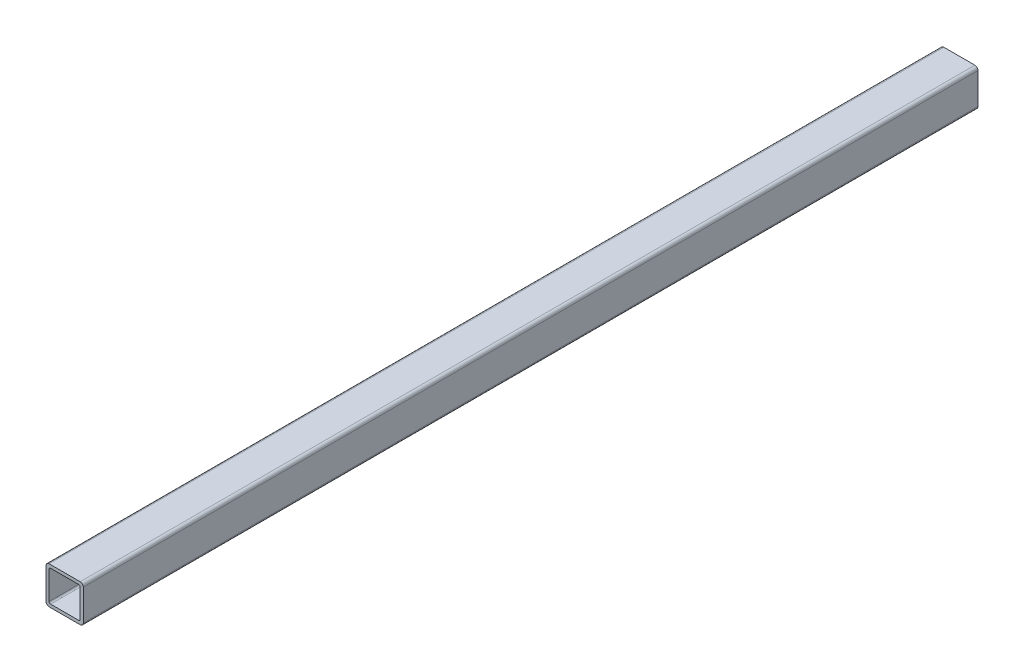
ISO-10303-21;
HEADER;
FILE_DESCRIPTION(('STEP AP214'),'2;1');
FILE_NAME('part.step','',(''),(''),'','','');
FILE_SCHEMA(('AUTOMOTIVE_DESIGN { 1 0 10303 214 1 1 1 1 }'));
ENDSEC;
DATA;
#1=APPLICATION_CONTEXT('core data for automotive mechanical design processes');
#2=APPLICATION_PROTOCOL_DEFINITION('international standard','automotive_design',2000,#1);
#3=PRODUCT_CONTEXT('',#1,'mechanical');
#4=PRODUCT('Part','Part','',(#3));
#5=PRODUCT_RELATED_PRODUCT_CATEGORY('part','',(#4));
#6=PRODUCT_DEFINITION_FORMATION('','',#4);
#7=PRODUCT_DEFINITION_CONTEXT('part definition',#1,'design');
#8=PRODUCT_DEFINITION('design','',#6,#7);
#9=PRODUCT_DEFINITION_SHAPE('','',#8);
#10=(LENGTH_UNIT() NAMED_UNIT(*) SI_UNIT(.MILLI.,.METRE.));
#11=(NAMED_UNIT(*) PLANE_ANGLE_UNIT() SI_UNIT($,.RADIAN.));
#12=(NAMED_UNIT(*) SI_UNIT($,.STERADIAN.) SOLID_ANGLE_UNIT());
#13=UNCERTAINTY_MEASURE_WITH_UNIT(LENGTH_MEASURE(1.E-05),#10,'distance_accuracy_value','');
#14=(GEOMETRIC_REPRESENTATION_CONTEXT(3) GLOBAL_UNCERTAINTY_ASSIGNED_CONTEXT((#13)) GLOBAL_UNIT_ASSIGNED_CONTEXT((#10,
#11,#12)) REPRESENTATION_CONTEXT('',''));
#15=CARTESIAN_POINT('',(0.,0.,0.));
#16=DIRECTION('',(0.,0.,1.));
#17=DIRECTION('',(1.,0.,0.));
#18=AXIS2_PLACEMENT_3D('',#15,#16,#17);
#19=CARTESIAN_POINT('',(-15.875,-15.875,457.2));
#20=DIRECTION('',(0.,0.,1.));
#21=DIRECTION('',(1.,0.,0.));
#22=AXIS2_PLACEMENT_3D('',#19,#20,#21);
#23=PLANE('',#22);
#24=CARTESIAN_POINT('',(-15.875,-15.875,457.2));
#25=DIRECTION('',(0.,0.,1.));
#26=DIRECTION('',(1.,0.,0.));
#27=AXIS2_PLACEMENT_3D('',#24,#25,#26);
#28=CIRCLE('',#27,3.175);
#29=CARTESIAN_POINT('',(-19.05,-15.875,457.2));
#30=VERTEX_POINT('',#29);
#31=CARTESIAN_POINT('',(-15.875,-19.05,457.2));
#32=VERTEX_POINT('',#31);
#33=EDGE_CURVE('E211',#30,#32,#28,.T.);
#34=ORIENTED_EDGE('',*,*,#33,.T.);
#35=DIRECTION('',(1.,0.,0.));
#36=VECTOR('',#35,1.);
#37=CARTESIAN_POINT('',(-15.875,-19.05,457.2));
#38=LINE('',#37,#36);
#39=CARTESIAN_POINT('',(15.875,-19.05,457.2));
#40=VERTEX_POINT('',#39);
#41=EDGE_CURVE('E214',#32,#40,#38,.T.);
#42=ORIENTED_EDGE('',*,*,#41,.T.);
#43=CARTESIAN_POINT('',(15.875,-15.875,457.2));
#44=DIRECTION('',(0.,0.,1.));
#45=DIRECTION('',(1.,0.,0.));
#46=AXIS2_PLACEMENT_3D('',#43,#44,#45);
#47=CIRCLE('',#46,3.175);
#48=CARTESIAN_POINT('',(19.05,-15.875,457.2));
#49=VERTEX_POINT('',#48);
#50=EDGE_CURVE('E217',#40,#49,#47,.T.);
#51=ORIENTED_EDGE('',*,*,#50,.T.);
#52=DIRECTION('',(0.,1.,0.));
#53=VECTOR('',#52,1.);
#54=CARTESIAN_POINT('',(19.05,15.875,457.2));
#55=LINE('',#54,#53);
#56=CARTESIAN_POINT('',(19.05,15.875,457.2));
#57=VERTEX_POINT('',#56);
#58=EDGE_CURVE('E219',#49,#57,#55,.T.);
#59=ORIENTED_EDGE('',*,*,#58,.T.);
#60=CARTESIAN_POINT('',(15.875,15.875,457.2));
#61=DIRECTION('',(0.,0.,1.));
#62=DIRECTION('',(-1.,0.,0.));
#63=AXIS2_PLACEMENT_3D('',#60,#61,#62);
#64=CIRCLE('',#63,3.175);
#65=CARTESIAN_POINT('',(15.875,19.05,457.2));
#66=VERTEX_POINT('',#65);
#67=EDGE_CURVE('E221',#57,#66,#64,.T.);
#68=ORIENTED_EDGE('',*,*,#67,.T.);
#69=DIRECTION('',(-1.,0.,0.));
#70=VECTOR('',#69,1.);
#71=CARTESIAN_POINT('',(-15.875,19.05,457.2));
#72=LINE('',#71,#70);
#73=CARTESIAN_POINT('',(-15.875,19.05,457.2));
#74=VERTEX_POINT('',#73);
#75=EDGE_CURVE('E223',#66,#74,#72,.T.);
#76=ORIENTED_EDGE('',*,*,#75,.T.);
#77=CARTESIAN_POINT('',(-15.875,15.875,457.2));
#78=DIRECTION('',(0.,0.,1.));
#79=DIRECTION('',(1.,0.,0.));
#80=AXIS2_PLACEMENT_3D('',#77,#78,#79);
#81=CIRCLE('',#80,3.175);
#82=CARTESIAN_POINT('',(-19.05,15.875,457.2));
#83=VERTEX_POINT('',#82);
#84=EDGE_CURVE('E225',#74,#83,#81,.T.);
#85=ORIENTED_EDGE('',*,*,#84,.T.);
#86=DIRECTION('',(0.,-1.,0.));
#87=VECTOR('',#86,1.);
#88=CARTESIAN_POINT('',(-19.05,15.875,457.2));
#89=LINE('',#88,#87);
#90=EDGE_CURVE('E227',#83,#30,#89,.T.);
#91=ORIENTED_EDGE('',*,*,#90,.T.);
#92=EDGE_LOOP('',(#34,#42,#51,#59,#68,#76,#85,#91));
#93=FACE_BOUND('',#92,.T.);
#94=DIRECTION('',(0.,-1.,0.));
#95=VECTOR('',#94,1.);
#96=CARTESIAN_POINT('',(-15.875,14.2875,457.2));
#97=LINE('',#96,#95);
#98=CARTESIAN_POINT('',(-15.875,14.2875,457.2));
#99=VERTEX_POINT('',#98);
#100=CARTESIAN_POINT('',(-15.875,-14.2875,457.2));
#101=VERTEX_POINT('',#100);
#102=EDGE_CURVE('E154',#99,#101,#97,.T.);
#103=ORIENTED_EDGE('',*,*,#102,.F.);
#104=CARTESIAN_POINT('',(-14.2875,14.2875,457.2));
#105=DIRECTION('',(0.,0.,1.));
#106=DIRECTION('',(1.,0.,0.));
#107=AXIS2_PLACEMENT_3D('',#104,#105,#106);
#108=CIRCLE('',#107,1.5875);
#109=CARTESIAN_POINT('',(-14.2875,15.875,457.2));
#110=VERTEX_POINT('',#109);
#111=EDGE_CURVE('E146',#110,#99,#108,.T.);
#112=ORIENTED_EDGE('',*,*,#111,.F.);
#113=DIRECTION('',(-1.,0.,0.));
#114=VECTOR('',#113,1.);
#115=CARTESIAN_POINT('',(-14.2875,15.875,457.2));
#116=LINE('',#115,#114);
#117=CARTESIAN_POINT('',(14.2875,15.875,457.2));
#118=VERTEX_POINT('',#117);
#119=EDGE_CURVE('E179',#118,#110,#116,.T.);
#120=ORIENTED_EDGE('',*,*,#119,.F.);
#121=CARTESIAN_POINT('',(14.2875,14.2875,457.2));
#122=DIRECTION('',(0.,0.,1.));
#123=DIRECTION('',(-1.,0.,0.));
#124=AXIS2_PLACEMENT_3D('',#121,#122,#123);
#125=CIRCLE('',#124,1.5875);
#126=CARTESIAN_POINT('',(15.875,14.2875,457.2));
#127=VERTEX_POINT('',#126);
#128=EDGE_CURVE('E177',#127,#118,#125,.T.);
#129=ORIENTED_EDGE('',*,*,#128,.F.);
#130=DIRECTION('',(0.,1.,0.));
#131=VECTOR('',#130,1.);
#132=CARTESIAN_POINT('',(15.875,14.2875,457.2));
#133=LINE('',#132,#131);
#134=CARTESIAN_POINT('',(15.875,-14.2875,457.2));
#135=VERTEX_POINT('',#134);
#136=EDGE_CURVE('E175',#135,#127,#133,.T.);
#137=ORIENTED_EDGE('',*,*,#136,.F.);
#138=CARTESIAN_POINT('',(14.2875,-14.2875,457.2));
#139=DIRECTION('',(0.,0.,1.));
#140=DIRECTION('',(1.,0.,0.));
#141=AXIS2_PLACEMENT_3D('',#138,#139,#140);
#142=CIRCLE('',#141,1.5875);
#143=CARTESIAN_POINT('',(14.2875,-15.875,457.2));
#144=VERTEX_POINT('',#143);
#145=EDGE_CURVE('E173',#144,#135,#142,.T.);
#146=ORIENTED_EDGE('',*,*,#145,.F.);
#147=DIRECTION('',(1.,0.,0.));
#148=VECTOR('',#147,1.);
#149=CARTESIAN_POINT('',(-14.2875,-15.875,457.2));
#150=LINE('',#149,#148);
#151=CARTESIAN_POINT('',(-14.2875,-15.875,457.2));
#152=VERTEX_POINT('',#151);
#153=EDGE_CURVE('E169',#152,#144,#150,.T.);
#154=ORIENTED_EDGE('',*,*,#153,.F.);
#155=CARTESIAN_POINT('',(-14.2875,-14.2875,457.2));
#156=DIRECTION('',(0.,0.,1.));
#157=DIRECTION('',(1.,0.,0.));
#158=AXIS2_PLACEMENT_3D('',#155,#156,#157);
#159=CIRCLE('',#158,1.5875);
#160=EDGE_CURVE('E167',#101,#152,#159,.T.);
#161=ORIENTED_EDGE('',*,*,#160,.F.);
#162=EDGE_LOOP('',(#103,#112,#120,#129,#137,#146,#154,#161));
#163=FACE_BOUND('',#162,.T.);
#164=ADVANCED_FACE('F33',(#93,#163),#23,.T.);
#165=CARTESIAN_POINT('',(-15.875,-15.875,-457.2));
#166=DIRECTION('',(0.,0.,1.));
#167=DIRECTION('',(1.,0.,0.));
#168=AXIS2_PLACEMENT_3D('',#165,#166,#167);
#169=PLANE('',#168);
#170=CARTESIAN_POINT('',(-15.875,-15.875,-457.2));
#171=DIRECTION('',(0.,0.,1.));
#172=DIRECTION('',(1.,0.,0.));
#173=AXIS2_PLACEMENT_3D('',#170,#171,#172);
#174=CIRCLE('',#173,3.175);
#175=CARTESIAN_POINT('',(-19.05,-15.875,-457.2));
#176=VERTEX_POINT('',#175);
#177=CARTESIAN_POINT('',(-15.875,-19.05,-457.2));
#178=VERTEX_POINT('',#177);
#179=EDGE_CURVE('E162',#176,#178,#174,.T.);
#180=ORIENTED_EDGE('',*,*,#179,.F.);
#181=DIRECTION('',(0.,-1.,0.));
#182=VECTOR('',#181,1.);
#183=CARTESIAN_POINT('',(-19.05,15.875,-457.2));
#184=LINE('',#183,#182);
#185=CARTESIAN_POINT('',(-19.05,15.875,-457.2));
#186=VERTEX_POINT('',#185);
#187=EDGE_CURVE('E215',#186,#176,#184,.T.);
#188=ORIENTED_EDGE('',*,*,#187,.F.);
#189=CARTESIAN_POINT('',(-15.875,15.875,-457.2));
#190=DIRECTION('',(0.,0.,1.));
#191=DIRECTION('',(1.,0.,0.));
#192=AXIS2_PLACEMENT_3D('',#189,#190,#191);
#193=CIRCLE('',#192,3.175);
#194=CARTESIAN_POINT('',(-15.875,19.05,-457.2));
#195=VERTEX_POINT('',#194);
#196=EDGE_CURVE('E242',#195,#186,#193,.T.);
#197=ORIENTED_EDGE('',*,*,#196,.F.);
#198=DIRECTION('',(-1.,0.,0.));
#199=VECTOR('',#198,1.);
#200=CARTESIAN_POINT('',(-15.875,19.05,-457.2));
#201=LINE('',#200,#199);
#202=CARTESIAN_POINT('',(15.875,19.05,-457.2));
#203=VERTEX_POINT('',#202);
#204=EDGE_CURVE('E240',#203,#195,#201,.T.);
#205=ORIENTED_EDGE('',*,*,#204,.F.);
#206=CARTESIAN_POINT('',(15.875,15.875,-457.2));
#207=DIRECTION('',(0.,0.,1.));
#208=DIRECTION('',(-1.,0.,0.));
#209=AXIS2_PLACEMENT_3D('',#206,#207,#208);
#210=CIRCLE('',#209,3.175);
#211=CARTESIAN_POINT('',(19.05,15.875,-457.2));
#212=VERTEX_POINT('',#211);
#213=EDGE_CURVE('E238',#212,#203,#210,.T.);
#214=ORIENTED_EDGE('',*,*,#213,.F.);
#215=DIRECTION('',(0.,1.,0.));
#216=VECTOR('',#215,1.);
#217=CARTESIAN_POINT('',(19.05,15.875,-457.2));
#218=LINE('',#217,#216);
#219=CARTESIAN_POINT('',(19.05,-15.875,-457.2));
#220=VERTEX_POINT('',#219);
#221=EDGE_CURVE('E236',#220,#212,#218,.T.);
#222=ORIENTED_EDGE('',*,*,#221,.F.);
#223=CARTESIAN_POINT('',(15.875,-15.875,-457.2));
#224=DIRECTION('',(0.,0.,1.));
#225=DIRECTION('',(1.,0.,0.));
#226=AXIS2_PLACEMENT_3D('',#223,#224,#225);
#227=CIRCLE('',#226,3.175);
#228=CARTESIAN_POINT('',(15.875,-19.05,-457.2));
#229=VERTEX_POINT('',#228);
#230=EDGE_CURVE('E234',#229,#220,#227,.T.);
#231=ORIENTED_EDGE('',*,*,#230,.F.);
#232=DIRECTION('',(1.,0.,0.));
#233=VECTOR('',#232,1.);
#234=CARTESIAN_POINT('',(-15.875,-19.05,-457.2));
#235=LINE('',#234,#233);
#236=EDGE_CURVE('E232',#178,#229,#235,.T.);
#237=ORIENTED_EDGE('',*,*,#236,.F.);
#238=EDGE_LOOP('',(#180,#188,#197,#205,#214,#222,#231,#237));
#239=FACE_BOUND('',#238,.T.);
#240=CARTESIAN_POINT('',(-14.2875,14.2875,-457.2));
#241=DIRECTION('',(0.,0.,1.));
#242=DIRECTION('',(1.,0.,0.));
#243=AXIS2_PLACEMENT_3D('',#240,#241,#242);
#244=CIRCLE('',#243,1.5875);
#245=CARTESIAN_POINT('',(-14.2875,15.875,-457.2));
#246=VERTEX_POINT('',#245);
#247=CARTESIAN_POINT('',(-15.875,14.2875,-457.2));
#248=VERTEX_POINT('',#247);
#249=EDGE_CURVE('E56',#246,#248,#244,.T.);
#250=ORIENTED_EDGE('',*,*,#249,.T.);
#251=DIRECTION('',(0.,-1.,0.));
#252=VECTOR('',#251,1.);
#253=CARTESIAN_POINT('',(-15.875,14.2875,-457.2));
#254=LINE('',#253,#252);
#255=CARTESIAN_POINT('',(-15.875,-14.2875,-457.2));
#256=VERTEX_POINT('',#255);
#257=EDGE_CURVE('E161',#248,#256,#254,.T.);
#258=ORIENTED_EDGE('',*,*,#257,.T.);
#259=CARTESIAN_POINT('',(-14.2875,-14.2875,-457.2));
#260=DIRECTION('',(0.,0.,1.));
#261=DIRECTION('',(1.,0.,0.));
#262=AXIS2_PLACEMENT_3D('',#259,#260,#261);
#263=CIRCLE('',#262,1.5875);
#264=CARTESIAN_POINT('',(-14.2875,-15.875,-457.2));
#265=VERTEX_POINT('',#264);
#266=EDGE_CURVE('E183',#256,#265,#263,.T.);
#267=ORIENTED_EDGE('',*,*,#266,.T.);
#268=DIRECTION('',(1.,0.,0.));
#269=VECTOR('',#268,1.);
#270=CARTESIAN_POINT('',(-14.2875,-15.875,-457.2));
#271=LINE('',#270,#269);
#272=CARTESIAN_POINT('',(14.2875,-15.875,-457.2));
#273=VERTEX_POINT('',#272);
#274=EDGE_CURVE('E186',#265,#273,#271,.T.);
#275=ORIENTED_EDGE('',*,*,#274,.T.);
#276=CARTESIAN_POINT('',(14.2875,-14.2875,-457.2));
#277=DIRECTION('',(0.,0.,1.));
#278=DIRECTION('',(1.,0.,0.));
#279=AXIS2_PLACEMENT_3D('',#276,#277,#278);
#280=CIRCLE('',#279,1.5875);
#281=CARTESIAN_POINT('',(15.875,-14.2875,-457.2));
#282=VERTEX_POINT('',#281);
#283=EDGE_CURVE('E189',#273,#282,#280,.T.);
#284=ORIENTED_EDGE('',*,*,#283,.T.);
#285=DIRECTION('',(0.,1.,0.));
#286=VECTOR('',#285,1.);
#287=CARTESIAN_POINT('',(15.875,14.2875,-457.2));
#288=LINE('',#287,#286);
#289=CARTESIAN_POINT('',(15.875,14.2875,-457.2));
#290=VERTEX_POINT('',#289);
#291=EDGE_CURVE('E192',#282,#290,#288,.T.);
#292=ORIENTED_EDGE('',*,*,#291,.T.);
#293=CARTESIAN_POINT('',(14.2875,14.2875,-457.2));
#294=DIRECTION('',(0.,0.,1.));
#295=DIRECTION('',(-1.,0.,0.));
#296=AXIS2_PLACEMENT_3D('',#293,#294,#295);
#297=CIRCLE('',#296,1.5875);
#298=CARTESIAN_POINT('',(14.2875,15.875,-457.2));
#299=VERTEX_POINT('',#298);
#300=EDGE_CURVE('E195',#290,#299,#297,.T.);
#301=ORIENTED_EDGE('',*,*,#300,.T.);
#302=DIRECTION('',(-1.,0.,0.));
#303=VECTOR('',#302,1.);
#304=CARTESIAN_POINT('',(-14.2875,15.875,-457.2));
#305=LINE('',#304,#303);
#306=EDGE_CURVE('E155',#299,#246,#305,.T.);
#307=ORIENTED_EDGE('',*,*,#306,.T.);
#308=EDGE_LOOP('',(#250,#258,#267,#275,#284,#292,#301,#307));
#309=FACE_BOUND('',#308,.T.);
#310=ADVANCED_FACE('F272',(#239,#309),#169,.F.);
#311=CARTESIAN_POINT('',(-15.875,-15.875,457.2));
#312=DIRECTION('',(0.,0.,-1.));
#313=DIRECTION('',(-1.,0.,0.));
#314=AXIS2_PLACEMENT_3D('',#311,#312,#313);
#315=CYLINDRICAL_SURFACE('',#314,3.175);
#316=ORIENTED_EDGE('',*,*,#179,.T.);
#317=DIRECTION('',(0.,0.,-1.));
#318=VECTOR('',#317,1.);
#319=CARTESIAN_POINT('',(-15.875,-19.05,457.2));
#320=LINE('',#319,#318);
#321=EDGE_CURVE('E11',#32,#178,#320,.T.);
#322=ORIENTED_EDGE('',*,*,#321,.F.);
#323=ORIENTED_EDGE('',*,*,#33,.F.);
#324=DIRECTION('',(0.,0.,-1.));
#325=VECTOR('',#324,1.);
#326=CARTESIAN_POINT('',(-19.05,-15.875,457.2));
#327=LINE('',#326,#325);
#328=EDGE_CURVE('E229',#30,#176,#327,.T.);
#329=ORIENTED_EDGE('',*,*,#328,.T.);
#330=EDGE_LOOP('',(#316,#322,#323,#329));
#331=FACE_BOUND('',#330,.T.);
#332=ADVANCED_FACE('F35',(#331),#315,.T.);
#333=CARTESIAN_POINT('',(-15.875,-19.05,457.2));
#334=DIRECTION('',(0.,1.,0.));
#335=DIRECTION('',(-1.,0.,0.));
#336=AXIS2_PLACEMENT_3D('',#333,#334,#335);
#337=PLANE('',#336);
#338=ORIENTED_EDGE('',*,*,#236,.T.);
#339=DIRECTION('',(0.,0.,-1.));
#340=VECTOR('',#339,1.);
#341=CARTESIAN_POINT('',(15.875,-19.05,457.2));
#342=LINE('',#341,#340);
#343=EDGE_CURVE('E41',#40,#229,#342,.T.);
#344=ORIENTED_EDGE('',*,*,#343,.F.);
#345=ORIENTED_EDGE('',*,*,#41,.F.);
#346=ORIENTED_EDGE('',*,*,#321,.T.);
#347=EDGE_LOOP('',(#338,#344,#345,#346));
#348=FACE_BOUND('',#347,.T.);
#349=ADVANCED_FACE('F289',(#348),#337,.F.);
#350=CARTESIAN_POINT('',(15.875,-15.875,457.2));
#351=DIRECTION('',(0.,0.,-1.));
#352=DIRECTION('',(-1.,0.,0.));
#353=AXIS2_PLACEMENT_3D('',#350,#351,#352);
#354=CYLINDRICAL_SURFACE('',#353,3.175);
#355=ORIENTED_EDGE('',*,*,#230,.T.);
#356=DIRECTION('',(0.,0.,-1.));
#357=VECTOR('',#356,1.);
#358=CARTESIAN_POINT('',(19.05,-15.875,457.2));
#359=LINE('',#358,#357);
#360=EDGE_CURVE('E259',#49,#220,#359,.T.);
#361=ORIENTED_EDGE('',*,*,#360,.F.);
#362=ORIENTED_EDGE('',*,*,#50,.F.);
#363=ORIENTED_EDGE('',*,*,#343,.T.);
#364=EDGE_LOOP('',(#355,#361,#362,#363));
#365=FACE_BOUND('',#364,.T.);
#366=ADVANCED_FACE('F266',(#365),#354,.T.);
#367=CARTESIAN_POINT('',(19.05,15.875,457.2));
#368=DIRECTION('',(-1.,0.,0.));
#369=DIRECTION('',(0.,0.,1.));
#370=AXIS2_PLACEMENT_3D('',#367,#368,#369);
#371=PLANE('',#370);
#372=ORIENTED_EDGE('',*,*,#221,.T.);
#373=DIRECTION('',(0.,0.,-1.));
#374=VECTOR('',#373,1.);
#375=CARTESIAN_POINT('',(19.05,15.875,457.2));
#376=LINE('',#375,#374);
#377=EDGE_CURVE('E256',#57,#212,#376,.T.);
#378=ORIENTED_EDGE('',*,*,#377,.F.);
#379=ORIENTED_EDGE('',*,*,#58,.F.);
#380=ORIENTED_EDGE('',*,*,#360,.T.);
#381=EDGE_LOOP('',(#372,#378,#379,#380));
#382=FACE_BOUND('',#381,.T.);
#383=ADVANCED_FACE('F278',(#382),#371,.F.);
#384=CARTESIAN_POINT('',(15.875,15.875,457.2));
#385=DIRECTION('',(0.,0.,-1.));
#386=DIRECTION('',(-1.,0.,0.));
#387=AXIS2_PLACEMENT_3D('',#384,#385,#386);
#388=CYLINDRICAL_SURFACE('',#387,3.175);
#389=ORIENTED_EDGE('',*,*,#213,.T.);
#390=DIRECTION('',(0.,0.,-1.));
#391=VECTOR('',#390,1.);
#392=CARTESIAN_POINT('',(15.875,19.05,457.2));
#393=LINE('',#392,#391);
#394=EDGE_CURVE('E253',#66,#203,#393,.T.);
#395=ORIENTED_EDGE('',*,*,#394,.F.);
#396=ORIENTED_EDGE('',*,*,#67,.F.);
#397=ORIENTED_EDGE('',*,*,#377,.T.);
#398=EDGE_LOOP('',(#389,#395,#396,#397));
#399=FACE_BOUND('',#398,.T.);
#400=ADVANCED_FACE('F282',(#399),#388,.T.);
#401=CARTESIAN_POINT('',(-15.875,19.05,457.2));
#402=DIRECTION('',(0.,-1.,0.));
#403=DIRECTION('',(0.,0.,-1.));
#404=AXIS2_PLACEMENT_3D('',#401,#402,#403);
#405=PLANE('',#404);
#406=ORIENTED_EDGE('',*,*,#204,.T.);
#407=DIRECTION('',(0.,0.,-1.));
#408=VECTOR('',#407,1.);
#409=CARTESIAN_POINT('',(-15.875,19.05,457.2));
#410=LINE('',#409,#408);
#411=EDGE_CURVE('E250',#74,#195,#410,.T.);
#412=ORIENTED_EDGE('',*,*,#411,.F.);
#413=ORIENTED_EDGE('',*,*,#75,.F.);
#414=ORIENTED_EDGE('',*,*,#394,.T.);
#415=EDGE_LOOP('',(#406,#412,#413,#414));
#416=FACE_BOUND('',#415,.T.);
#417=ADVANCED_FACE('F302',(#416),#405,.F.);
#418=CARTESIAN_POINT('',(-15.875,15.875,457.2));
#419=DIRECTION('',(0.,0.,-1.));
#420=DIRECTION('',(-1.,0.,0.));
#421=AXIS2_PLACEMENT_3D('',#418,#419,#420);
#422=CYLINDRICAL_SURFACE('',#421,3.175);
#423=ORIENTED_EDGE('',*,*,#196,.T.);
#424=DIRECTION('',(0.,0.,-1.));
#425=VECTOR('',#424,1.);
#426=CARTESIAN_POINT('',(-19.05,15.875,457.2));
#427=LINE('',#426,#425);
#428=EDGE_CURVE('E247',#83,#186,#427,.T.);
#429=ORIENTED_EDGE('',*,*,#428,.F.);
#430=ORIENTED_EDGE('',*,*,#84,.F.);
#431=ORIENTED_EDGE('',*,*,#411,.T.);
#432=EDGE_LOOP('',(#423,#429,#430,#431));
#433=FACE_BOUND('',#432,.T.);
#434=ADVANCED_FACE('F300',(#433),#422,.T.);
#435=CARTESIAN_POINT('',(-19.05,15.875,457.2));
#436=DIRECTION('',(1.,0.,0.));
#437=DIRECTION('',(0.,1.,0.));
#438=AXIS2_PLACEMENT_3D('',#435,#436,#437);
#439=PLANE('',#438);
#440=ORIENTED_EDGE('',*,*,#187,.T.);
#441=ORIENTED_EDGE('',*,*,#328,.F.);
#442=ORIENTED_EDGE('',*,*,#90,.F.);
#443=ORIENTED_EDGE('',*,*,#428,.T.);
#444=EDGE_LOOP('',(#440,#441,#442,#443));
#445=FACE_BOUND('',#444,.T.);
#446=ADVANCED_FACE('F295',(#445),#439,.F.);
#447=CARTESIAN_POINT('',(-14.2875,14.2875,457.2));
#448=DIRECTION('',(0.,0.,-1.));
#449=DIRECTION('',(-1.,0.,0.));
#450=AXIS2_PLACEMENT_3D('',#447,#448,#449);
#451=CYLINDRICAL_SURFACE('',#450,1.5875);
#452=ORIENTED_EDGE('',*,*,#249,.F.);
#453=DIRECTION('',(0.,0.,-1.));
#454=VECTOR('',#453,1.);
#455=CARTESIAN_POINT('',(-14.2875,15.875,457.2));
#456=LINE('',#455,#454);
#457=EDGE_CURVE('E150',#110,#246,#456,.T.);
#458=ORIENTED_EDGE('',*,*,#457,.F.);
#459=ORIENTED_EDGE('',*,*,#111,.T.);
#460=DIRECTION('',(0.,0.,-1.));
#461=VECTOR('',#460,1.);
#462=CARTESIAN_POINT('',(-15.875,14.2875,457.2));
#463=LINE('',#462,#461);
#464=EDGE_CURVE('E149',#99,#248,#463,.T.);
#465=ORIENTED_EDGE('',*,*,#464,.T.);
#466=EDGE_LOOP('',(#452,#458,#459,#465));
#467=FACE_BOUND('',#466,.T.);
#468=ADVANCED_FACE('F148',(#467),#451,.F.);
#469=CARTESIAN_POINT('',(-15.875,14.2875,457.2));
#470=DIRECTION('',(1.,0.,0.));
#471=DIRECTION('',(0.,0.,-1.));
#472=AXIS2_PLACEMENT_3D('',#469,#470,#471);
#473=PLANE('',#472);
#474=ORIENTED_EDGE('',*,*,#257,.F.);
#475=ORIENTED_EDGE('',*,*,#464,.F.);
#476=ORIENTED_EDGE('',*,*,#102,.T.);
#477=DIRECTION('',(0.,0.,-1.));
#478=VECTOR('',#477,1.);
#479=CARTESIAN_POINT('',(-15.875,-14.2875,457.2));
#480=LINE('',#479,#478);
#481=EDGE_CURVE('E163',#101,#256,#480,.T.);
#482=ORIENTED_EDGE('',*,*,#481,.T.);
#483=EDGE_LOOP('',(#474,#475,#476,#482));
#484=FACE_BOUND('',#483,.T.);
#485=ADVANCED_FACE('F158',(#484),#473,.T.);
#486=CARTESIAN_POINT('',(-14.2875,-14.2875,457.2));
#487=DIRECTION('',(0.,0.,-1.));
#488=DIRECTION('',(-1.,0.,0.));
#489=AXIS2_PLACEMENT_3D('',#486,#487,#488);
#490=CYLINDRICAL_SURFACE('',#489,1.5875);
#491=ORIENTED_EDGE('',*,*,#266,.F.);
#492=ORIENTED_EDGE('',*,*,#481,.F.);
#493=ORIENTED_EDGE('',*,*,#160,.T.);
#494=DIRECTION('',(0.,0.,-1.));
#495=VECTOR('',#494,1.);
#496=CARTESIAN_POINT('',(-14.2875,-15.875,457.2));
#497=LINE('',#496,#495);
#498=EDGE_CURVE('E208',#152,#265,#497,.T.);
#499=ORIENTED_EDGE('',*,*,#498,.T.);
#500=EDGE_LOOP('',(#491,#492,#493,#499));
#501=FACE_BOUND('',#500,.T.);
#502=ADVANCED_FACE('F327',(#501),#490,.F.);
#503=CARTESIAN_POINT('',(-14.2875,-15.875,457.2));
#504=DIRECTION('',(0.,1.,0.));
#505=DIRECTION('',(0.,0.,1.));
#506=AXIS2_PLACEMENT_3D('',#503,#504,#505);
#507=PLANE('',#506);
#508=ORIENTED_EDGE('',*,*,#274,.F.);
#509=ORIENTED_EDGE('',*,*,#498,.F.);
#510=ORIENTED_EDGE('',*,*,#153,.T.);
#511=DIRECTION('',(0.,0.,-1.));
#512=VECTOR('',#511,1.);
#513=CARTESIAN_POINT('',(14.2875,-15.875,457.2));
#514=LINE('',#513,#512);
#515=EDGE_CURVE('E206',#144,#273,#514,.T.);
#516=ORIENTED_EDGE('',*,*,#515,.T.);
#517=EDGE_LOOP('',(#508,#509,#510,#516));
#518=FACE_BOUND('',#517,.T.);
#519=ADVANCED_FACE('F331',(#518),#507,.T.);
#520=CARTESIAN_POINT('',(14.2875,-14.2875,457.2));
#521=DIRECTION('',(0.,0.,-1.));
#522=DIRECTION('',(-1.,0.,0.));
#523=AXIS2_PLACEMENT_3D('',#520,#521,#522);
#524=CYLINDRICAL_SURFACE('',#523,1.5875);
#525=ORIENTED_EDGE('',*,*,#283,.F.);
#526=ORIENTED_EDGE('',*,*,#515,.F.);
#527=ORIENTED_EDGE('',*,*,#145,.T.);
#528=DIRECTION('',(0.,0.,-1.));
#529=VECTOR('',#528,1.);
#530=CARTESIAN_POINT('',(15.875,-14.2875,457.2));
#531=LINE('',#530,#529);
#532=EDGE_CURVE('E204',#135,#282,#531,.T.);
#533=ORIENTED_EDGE('',*,*,#532,.T.);
#534=EDGE_LOOP('',(#525,#526,#527,#533));
#535=FACE_BOUND('',#534,.T.);
#536=ADVANCED_FACE('F337',(#535),#524,.F.);
#537=CARTESIAN_POINT('',(15.875,14.2875,457.2));
#538=DIRECTION('',(-1.,0.,0.));
#539=DIRECTION('',(0.,-1.,0.));
#540=AXIS2_PLACEMENT_3D('',#537,#538,#539);
#541=PLANE('',#540);
#542=ORIENTED_EDGE('',*,*,#291,.F.);
#543=ORIENTED_EDGE('',*,*,#532,.F.);
#544=ORIENTED_EDGE('',*,*,#136,.T.);
#545=DIRECTION('',(0.,0.,-1.));
#546=VECTOR('',#545,1.);
#547=CARTESIAN_POINT('',(15.875,14.2875,457.2));
#548=LINE('',#547,#546);
#549=EDGE_CURVE('E202',#127,#290,#548,.T.);
#550=ORIENTED_EDGE('',*,*,#549,.T.);
#551=EDGE_LOOP('',(#542,#543,#544,#550));
#552=FACE_BOUND('',#551,.T.);
#553=ADVANCED_FACE('F341',(#552),#541,.T.);
#554=CARTESIAN_POINT('',(14.2875,14.2875,457.2));
#555=DIRECTION('',(0.,0.,-1.));
#556=DIRECTION('',(-1.,0.,0.));
#557=AXIS2_PLACEMENT_3D('',#554,#555,#556);
#558=CYLINDRICAL_SURFACE('',#557,1.5875);
#559=ORIENTED_EDGE('',*,*,#300,.F.);
#560=ORIENTED_EDGE('',*,*,#549,.F.);
#561=ORIENTED_EDGE('',*,*,#128,.T.);
#562=DIRECTION('',(0.,0.,-1.));
#563=VECTOR('',#562,1.);
#564=CARTESIAN_POINT('',(14.2875,15.875,457.2));
#565=LINE('',#564,#563);
#566=EDGE_CURVE('E48',#118,#299,#565,.T.);
#567=ORIENTED_EDGE('',*,*,#566,.T.);
#568=EDGE_LOOP('',(#559,#560,#561,#567));
#569=FACE_BOUND('',#568,.T.);
#570=ADVANCED_FACE('F345',(#569),#558,.F.);
#571=CARTESIAN_POINT('',(-14.2875,15.875,457.2));
#572=DIRECTION('',(0.,-1.,0.));
#573=DIRECTION('',(0.,0.,-1.));
#574=AXIS2_PLACEMENT_3D('',#571,#572,#573);
#575=PLANE('',#574);
#576=ORIENTED_EDGE('',*,*,#306,.F.);
#577=ORIENTED_EDGE('',*,*,#566,.F.);
#578=ORIENTED_EDGE('',*,*,#119,.T.);
#579=ORIENTED_EDGE('',*,*,#457,.T.);
#580=EDGE_LOOP('',(#576,#577,#578,#579));
#581=FACE_BOUND('',#580,.T.);
#582=ADVANCED_FACE('F349',(#581),#575,.T.);
#583=CLOSED_SHELL('',(#164,#310,#332,#349,#366,#383,#400,#417,#434,#446,#468,#485,#502,#519,
#536,#553,#570,#582));
#584=MANIFOLD_SOLID_BREP('B2',#583);
#585=ADVANCED_BREP_SHAPE_REPRESENTATION('',(#18,#584),#14);
#586=SHAPE_DEFINITION_REPRESENTATION(#9,#585);
ENDSEC;
END-ISO-10303-21;
